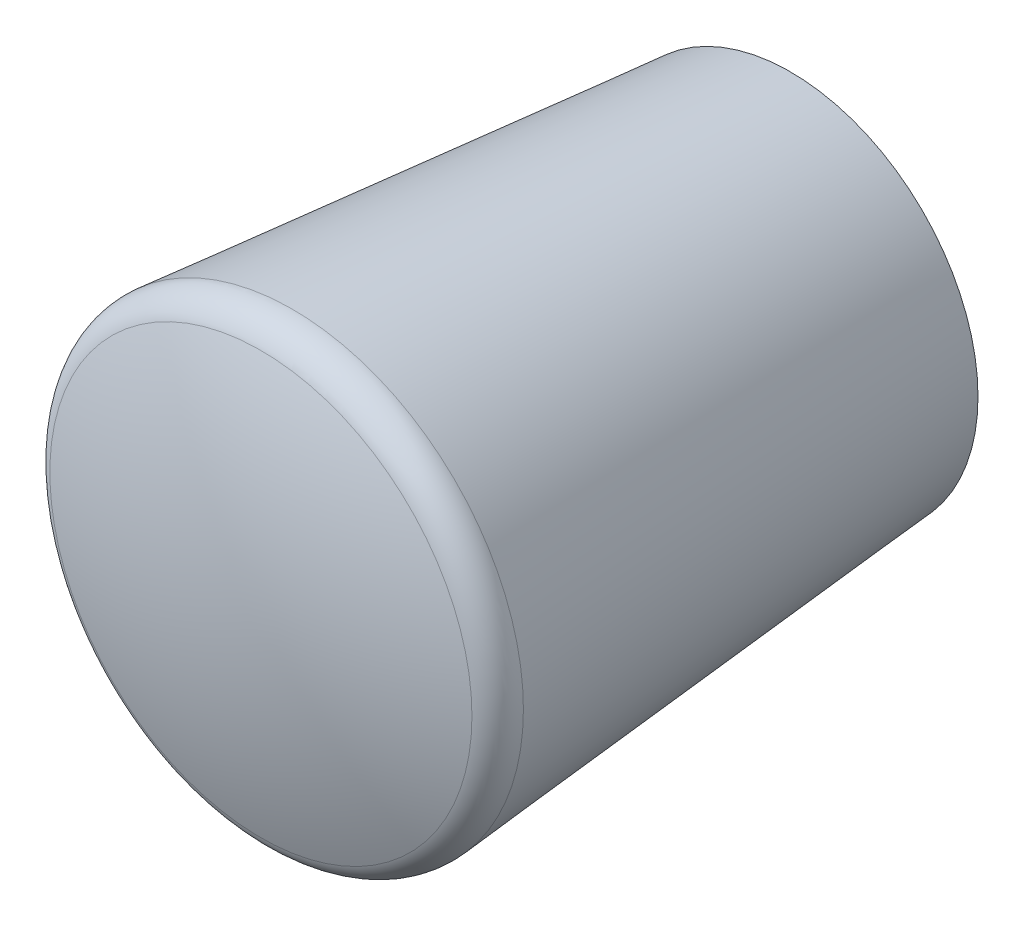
ISO-10303-21;
HEADER;
FILE_DESCRIPTION(('STEP AP214'),'2;1');
FILE_NAME('part.step','',(''),(''),'','','');
FILE_SCHEMA(('AUTOMOTIVE_DESIGN { 1 0 10303 214 1 1 1 1 }'));
ENDSEC;
DATA;
#1=APPLICATION_CONTEXT('core data for automotive mechanical design processes');
#2=APPLICATION_PROTOCOL_DEFINITION('international standard','automotive_design',2000,#1);
#3=PRODUCT_CONTEXT('',#1,'mechanical');
#4=PRODUCT('Part','Part','',(#3));
#5=PRODUCT_RELATED_PRODUCT_CATEGORY('part','',(#4));
#6=PRODUCT_DEFINITION_FORMATION('','',#4);
#7=PRODUCT_DEFINITION_CONTEXT('part definition',#1,'design');
#8=PRODUCT_DEFINITION('design','',#6,#7);
#9=PRODUCT_DEFINITION_SHAPE('','',#8);
#10=(LENGTH_UNIT() NAMED_UNIT(*) SI_UNIT(.MILLI.,.METRE.));
#11=(NAMED_UNIT(*) PLANE_ANGLE_UNIT() SI_UNIT($,.RADIAN.));
#12=(NAMED_UNIT(*) SI_UNIT($,.STERADIAN.) SOLID_ANGLE_UNIT());
#13=UNCERTAINTY_MEASURE_WITH_UNIT(LENGTH_MEASURE(1.E-05),#10,'distance_accuracy_value','');
#14=(GEOMETRIC_REPRESENTATION_CONTEXT(3) GLOBAL_UNCERTAINTY_ASSIGNED_CONTEXT((#13)) GLOBAL_UNIT_ASSIGNED_CONTEXT((#10,
#11,#12)) REPRESENTATION_CONTEXT('',''));
#15=CARTESIAN_POINT('',(0.,0.,0.));
#16=DIRECTION('',(0.,0.,1.));
#17=DIRECTION('',(1.,0.,0.));
#18=AXIS2_PLACEMENT_3D('',#15,#16,#17);
#19=CARTESIAN_POINT('',(2.5,0.,12.));
#20=DIRECTION('',(0.,0.,-1.));
#21=DIRECTION('',(1.,0.,0.));
#22=AXIS2_PLACEMENT_3D('',#19,#20,#21);
#23=PLANE('',#22);
#24=CARTESIAN_POINT('',(0.,0.,12.));
#25=DIRECTION('',(0.,0.,-1.));
#26=DIRECTION('',(1.,0.,0.));
#27=AXIS2_PLACEMENT_3D('',#24,#25,#26);
#28=CIRCLE('',#27,2.5);
#29=CARTESIAN_POINT('',(2.50000000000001,0.,12.));
#30=VERTEX_POINT('',#29);
#31=EDGE_CURVE('E8',#30,#30,#28,.T.);
#32=ORIENTED_EDGE('',*,*,#31,.T.);
#33=EDGE_LOOP('',(#32));
#34=FACE_BOUND('',#33,.T.);
#35=ADVANCED_FACE('F12',(#34),#23,.T.);
#36=CARTESIAN_POINT('',(0.,0.,0.));
#37=DIRECTION('',(0.,0.,-1.));
#38=DIRECTION('',(1.,0.,0.));
#39=AXIS2_PLACEMENT_3D('',#36,#37,#38);
#40=CYLINDRICAL_SURFACE('',#39,2.5);
#41=CARTESIAN_POINT('',(0.,0.,0.));
#42=DIRECTION('',(0.,0.,-1.));
#43=DIRECTION('',(1.,0.,0.));
#44=AXIS2_PLACEMENT_3D('',#41,#42,#43);
#45=CIRCLE('',#44,2.5);
#46=CARTESIAN_POINT('',(2.50000000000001,0.,0.));
#47=VERTEX_POINT('',#46);
#48=EDGE_CURVE('E18',#47,#47,#45,.T.);
#49=ORIENTED_EDGE('',*,*,#48,.T.);
#50=EDGE_LOOP('',(#49));
#51=FACE_BOUND('',#50,.T.);
#52=ORIENTED_EDGE('',*,*,#31,.F.);
#53=EDGE_LOOP('',(#52));
#54=FACE_BOUND('',#53,.T.);
#55=ADVANCED_FACE('F52',(#51,#54),#40,.F.);
#56=CARTESIAN_POINT('',(2.5,0.,0.));
#57=DIRECTION('',(0.,0.,-1.));
#58=DIRECTION('',(1.,0.,0.));
#59=AXIS2_PLACEMENT_3D('',#56,#57,#58);
#60=PLANE('',#59);
#61=CARTESIAN_POINT('',(0.,0.,0.));
#62=DIRECTION('',(0.,0.,-1.));
#63=DIRECTION('',(1.,0.,0.));
#64=AXIS2_PLACEMENT_3D('',#61,#62,#63);
#65=CIRCLE('',#64,3.5);
#66=CARTESIAN_POINT('',(3.50000000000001,0.,0.));
#67=VERTEX_POINT('',#66);
#68=EDGE_CURVE('E22',#67,#67,#65,.T.);
#69=ORIENTED_EDGE('',*,*,#68,.T.);
#70=EDGE_LOOP('',(#69));
#71=FACE_BOUND('',#70,.T.);
#72=ORIENTED_EDGE('',*,*,#48,.F.);
#73=EDGE_LOOP('',(#72));
#74=FACE_BOUND('',#73,.T.);
#75=ADVANCED_FACE('F57',(#71,#74),#60,.T.);
#76=CARTESIAN_POINT('',(0.,0.,0.));
#77=DIRECTION('',(0.,0.,1.));
#78=DIRECTION('',(-1.,0.,0.));
#79=AXIS2_PLACEMENT_3D('',#76,#77,#78);
#80=CONICAL_SURFACE('',#79,3.5,1.0471975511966);
#81=CARTESIAN_POINT('',(0.,0.,1.50848772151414));
#82=DIRECTION('',(0.,0.,-1.));
#83=DIRECTION('',(1.,0.,0.));
#84=AXIS2_PLACEMENT_3D('',#81,#82,#83);
#85=CIRCLE('',#84,6.1127773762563);
#86=CARTESIAN_POINT('',(6.11277737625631,0.,1.50848772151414));
#87=VERTEX_POINT('',#86);
#88=EDGE_CURVE('E26',#87,#87,#85,.T.);
#89=ORIENTED_EDGE('',*,*,#88,.T.);
#90=EDGE_LOOP('',(#89));
#91=FACE_BOUND('',#90,.T.);
#92=ORIENTED_EDGE('',*,*,#68,.F.);
#93=EDGE_LOOP('',(#92));
#94=FACE_BOUND('',#93,.T.);
#95=ADVANCED_FACE('F62',(#91,#94),#80,.T.);
#96=CARTESIAN_POINT('',(0.,0.,1.50848772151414));
#97=DIRECTION('',(0.,0.,1.));
#98=DIRECTION('',(-1.,0.,0.));
#99=AXIS2_PLACEMENT_3D('',#96,#97,#98);
#100=CONICAL_SURFACE('',#99,6.1127773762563,0.087266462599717);
#101=CARTESIAN_POINT('',(0.,0.,17.7526225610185));
#102=DIRECTION('',(0.,0.,-1.));
#103=DIRECTION('',(1.,0.,0.));
#104=AXIS2_PLACEMENT_3D('',#101,#102,#103);
#105=CIRCLE('',#104,7.53395502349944);
#106=CARTESIAN_POINT('',(7.53395502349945,0.,17.7526225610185));
#107=VERTEX_POINT('',#106);
#108=EDGE_CURVE('E31',#107,#107,#105,.T.);
#109=ORIENTED_EDGE('',*,*,#108,.T.);
#110=EDGE_LOOP('',(#109));
#111=FACE_BOUND('',#110,.T.);
#112=ORIENTED_EDGE('',*,*,#88,.F.);
#113=EDGE_LOOP('',(#112));
#114=FACE_BOUND('',#113,.T.);
#115=ADVANCED_FACE('F49',(#111,#114),#100,.T.);
#116=CARTESIAN_POINT('',(0.,0.,17.8397783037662));
#117=DIRECTION('',(0.,0.,-1.));
#118=DIRECTION('',(1.,0.,0.));
#119=AXIS2_PLACEMENT_3D('',#116,#117,#118);
#120=TOROIDAL_SURFACE('',#119,6.5377603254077,1.);
#121=CARTESIAN_POINT('',(0.,0.,18.7787140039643));
#122=DIRECTION('',(0.,0.,-1.));
#123=DIRECTION('',(1.,0.,0.));
#124=AXIS2_PLACEMENT_3D('',#121,#122,#123);
#125=CIRCLE('',#124,6.88185297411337);
#126=CARTESIAN_POINT('',(6.88185297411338,0.,18.7787140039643));
#127=VERTEX_POINT('',#126);
#128=EDGE_CURVE('E34',#127,#127,#125,.T.);
#129=ORIENTED_EDGE('',*,*,#128,.T.);
#130=EDGE_LOOP('',(#129));
#131=FACE_BOUND('',#130,.T.);
#132=ORIENTED_EDGE('',*,*,#108,.F.);
#133=EDGE_LOOP('',(#132));
#134=FACE_BOUND('',#133,.T.);
#135=ADVANCED_FACE('F38',(#131,#134),#120,.T.);
#136=CARTESIAN_POINT('',(0.,0.,0.));
#137=DIRECTION('',(0.,0.,-1.));
#138=DIRECTION('',(1.,0.,0.));
#139=AXIS2_PLACEMENT_3D('',#136,#137,#138);
#140=SPHERICAL_SURFACE('',#139,20.);
#141=ORIENTED_EDGE('',*,*,#128,.F.);
#142=EDGE_LOOP('',(#141));
#143=FACE_BOUND('',#142,.T.);
#144=ADVANCED_FACE('F41',(#143),#140,.T.);
#145=CLOSED_SHELL('',(#35,#55,#75,#95,#115,#135,#144));
#146=MANIFOLD_SOLID_BREP('B1',#145);
#147=ADVANCED_BREP_SHAPE_REPRESENTATION('',(#18,#146),#14);
#148=SHAPE_DEFINITION_REPRESENTATION(#9,#147);
ENDSEC;
END-ISO-10303-21;
